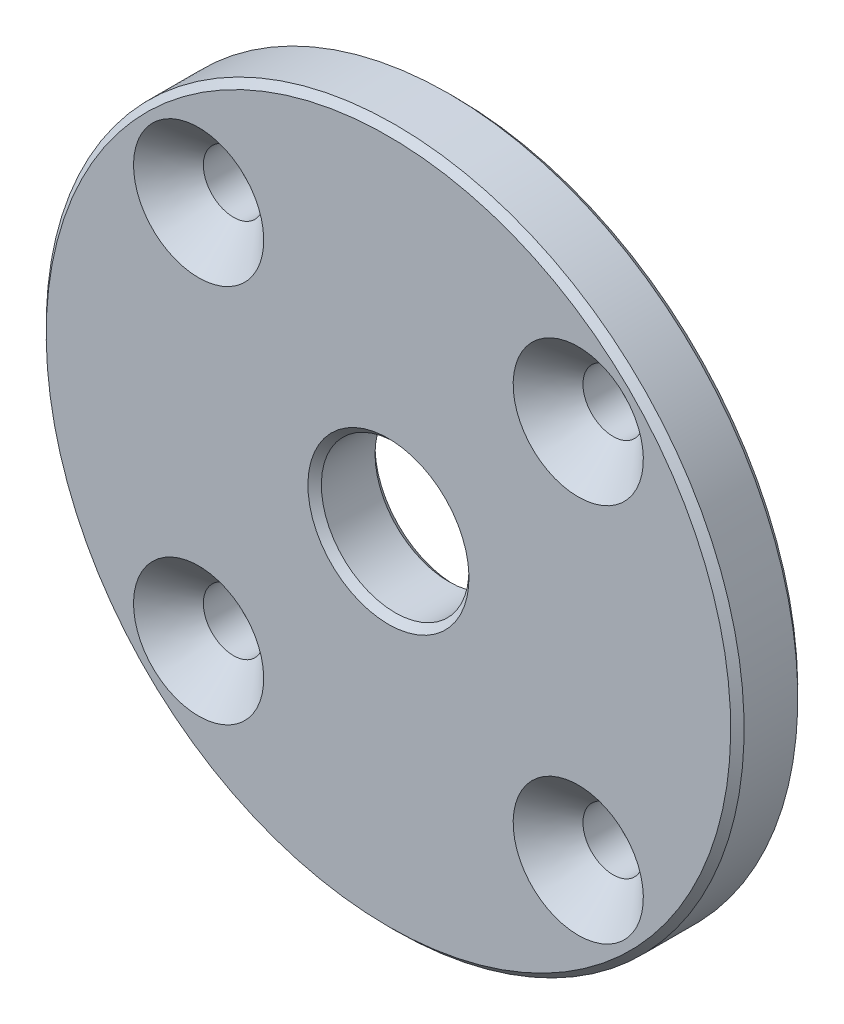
ISO-10303-21;
HEADER;
FILE_DESCRIPTION(('STEP AP214'),'2;1');
FILE_NAME('part.step','',(''),(''),'','','');
FILE_SCHEMA(('AUTOMOTIVE_DESIGN { 1 0 10303 214 1 1 1 1 }'));
ENDSEC;
DATA;
#1=APPLICATION_CONTEXT('core data for automotive mechanical design processes');
#2=APPLICATION_PROTOCOL_DEFINITION('international standard','automotive_design',2000,#1);
#3=PRODUCT_CONTEXT('',#1,'mechanical');
#4=PRODUCT('Part','Part','',(#3));
#5=PRODUCT_RELATED_PRODUCT_CATEGORY('part','',(#4));
#6=PRODUCT_DEFINITION_FORMATION('','',#4);
#7=PRODUCT_DEFINITION_CONTEXT('part definition',#1,'design');
#8=PRODUCT_DEFINITION('design','',#6,#7);
#9=PRODUCT_DEFINITION_SHAPE('','',#8);
#10=(LENGTH_UNIT() NAMED_UNIT(*) SI_UNIT(.MILLI.,.METRE.));
#11=(NAMED_UNIT(*) PLANE_ANGLE_UNIT() SI_UNIT($,.RADIAN.));
#12=(NAMED_UNIT(*) SI_UNIT($,.STERADIAN.) SOLID_ANGLE_UNIT());
#13=UNCERTAINTY_MEASURE_WITH_UNIT(LENGTH_MEASURE(1.E-05),#10,'distance_accuracy_value','');
#14=(GEOMETRIC_REPRESENTATION_CONTEXT(3) GLOBAL_UNCERTAINTY_ASSIGNED_CONTEXT((#13)) GLOBAL_UNIT_ASSIGNED_CONTEXT((#10,
#11,#12)) REPRESENTATION_CONTEXT('',''));
#15=CARTESIAN_POINT('',(0.,0.,0.));
#16=DIRECTION('',(0.,0.,1.));
#17=DIRECTION('',(1.,0.,0.));
#18=AXIS2_PLACEMENT_3D('',#15,#16,#17);
#19=CARTESIAN_POINT('',(5.5,0.,-5.));
#20=DIRECTION('',(0.,0.,-1.));
#21=DIRECTION('',(0.,1.,0.));
#22=AXIS2_PLACEMENT_3D('',#19,#20,#21);
#23=PLANE('',#22);
#24=CARTESIAN_POINT('',(0.,0.,-5.));
#25=DIRECTION('',(0.,0.,-1.));
#26=DIRECTION('',(0.,1.,0.));
#27=AXIS2_PLACEMENT_3D('',#24,#25,#26);
#28=CIRCLE('',#27,6.);
#29=CARTESIAN_POINT('',(0.,5.99999999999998,-5.00000000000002));
#30=VERTEX_POINT('',#29);
#31=EDGE_CURVE('E30',#30,#30,#28,.F.);
#32=ORIENTED_EDGE('',*,*,#31,.T.);
#33=EDGE_LOOP('',(#32));
#34=FACE_BOUND('',#33,.T.);
#35=CARTESIAN_POINT('',(14.1421356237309,14.142135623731,-5.));
#36=DIRECTION('',(0.,0.,-1.));
#37=DIRECTION('',(0.,1.,0.));
#38=AXIS2_PLACEMENT_3D('',#35,#36,#37);
#39=CIRCLE('',#38,2.25);
#40=CARTESIAN_POINT('',(14.1421356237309,16.392135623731,-5.00000000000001));
#41=VERTEX_POINT('',#40);
#42=EDGE_CURVE('E40',#41,#41,#39,.F.);
#43=ORIENTED_EDGE('',*,*,#42,.T.);
#44=EDGE_LOOP('',(#43));
#45=FACE_BOUND('',#44,.T.);
#46=CARTESIAN_POINT('',(-14.1421356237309,-14.142135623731,-5.));
#47=DIRECTION('',(0.,0.,-1.));
#48=DIRECTION('',(0.,1.,0.));
#49=AXIS2_PLACEMENT_3D('',#46,#47,#48);
#50=CIRCLE('',#49,2.25);
#51=CARTESIAN_POINT('',(-14.1421356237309,-11.892135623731,-5.00000000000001));
#52=VERTEX_POINT('',#51);
#53=EDGE_CURVE('E39',#52,#52,#50,.F.);
#54=ORIENTED_EDGE('',*,*,#53,.T.);
#55=EDGE_LOOP('',(#54));
#56=FACE_BOUND('',#55,.T.);
#57=CARTESIAN_POINT('',(0.,0.,-5.));
#58=DIRECTION('',(0.,0.,-1.));
#59=DIRECTION('',(0.,1.,0.));
#60=AXIS2_PLACEMENT_3D('',#57,#58,#59);
#61=CIRCLE('',#60,25.5);
#62=CARTESIAN_POINT('',(0.,25.5,-5.00000000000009));
#63=VERTEX_POINT('',#62);
#64=EDGE_CURVE('E35',#63,#63,#61,.T.);
#65=ORIENTED_EDGE('',*,*,#64,.T.);
#66=EDGE_LOOP('',(#65));
#67=FACE_BOUND('',#66,.T.);
#68=CARTESIAN_POINT('',(14.142135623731,-14.1421356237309,-5.));
#69=DIRECTION('',(0.,0.,-1.));
#70=DIRECTION('',(0.,1.,0.));
#71=AXIS2_PLACEMENT_3D('',#68,#69,#70);
#72=CIRCLE('',#71,2.25);
#73=CARTESIAN_POINT('',(14.142135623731,-11.8921356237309,-5.00000000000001));
#74=VERTEX_POINT('',#73);
#75=EDGE_CURVE('E36',#74,#74,#72,.F.);
#76=ORIENTED_EDGE('',*,*,#75,.T.);
#77=EDGE_LOOP('',(#76));
#78=FACE_BOUND('',#77,.T.);
#79=CARTESIAN_POINT('',(-14.142135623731,14.1421356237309,-5.));
#80=DIRECTION('',(0.,0.,-1.));
#81=DIRECTION('',(0.,1.,0.));
#82=AXIS2_PLACEMENT_3D('',#79,#80,#81);
#83=CIRCLE('',#82,2.25);
#84=CARTESIAN_POINT('',(-14.142135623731,16.3921356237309,-5.00000000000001));
#85=VERTEX_POINT('',#84);
#86=EDGE_CURVE('E43',#85,#85,#83,.F.);
#87=ORIENTED_EDGE('',*,*,#86,.T.);
#88=EDGE_LOOP('',(#87));
#89=FACE_BOUND('',#88,.T.);
#90=ADVANCED_FACE('F14',(#34,#45,#56,#67,#78,#89),#23,.T.);
#91=CARTESIAN_POINT('',(5.5,0.,0.));
#92=DIRECTION('',(0.,0.,1.));
#93=DIRECTION('',(0.,-1.,0.));
#94=AXIS2_PLACEMENT_3D('',#91,#92,#93);
#95=PLANE('',#94);
#96=CARTESIAN_POINT('',(0.,0.,0.));
#97=DIRECTION('',(0.,0.,1.));
#98=DIRECTION('',(0.,-1.,0.));
#99=AXIS2_PLACEMENT_3D('',#96,#97,#98);
#100=CIRCLE('',#99,6.);
#101=CARTESIAN_POINT('',(0.,-6.,0.));
#102=VERTEX_POINT('',#101);
#103=EDGE_CURVE('E9',#102,#102,#100,.F.);
#104=ORIENTED_EDGE('',*,*,#103,.T.);
#105=EDGE_LOOP('',(#104));
#106=FACE_BOUND('',#105,.T.);
#107=CARTESIAN_POINT('',(0.,0.,0.));
#108=DIRECTION('',(0.,0.,1.));
#109=DIRECTION('',(0.,-1.,0.));
#110=AXIS2_PLACEMENT_3D('',#107,#108,#109);
#111=CIRCLE('',#110,25.5);
#112=CARTESIAN_POINT('',(0.,-25.5,0.));
#113=VERTEX_POINT('',#112);
#114=EDGE_CURVE('E57',#113,#113,#111,.T.);
#115=ORIENTED_EDGE('',*,*,#114,.T.);
#116=EDGE_LOOP('',(#115));
#117=FACE_BOUND('',#116,.T.);
#118=CARTESIAN_POINT('',(-14.142135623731,14.1421356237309,0.));
#119=DIRECTION('',(0.,0.,1.));
#120=DIRECTION('',(0.,-1.,0.));
#121=AXIS2_PLACEMENT_3D('',#118,#119,#120);
#122=CIRCLE('',#121,4.85);
#123=CARTESIAN_POINT('',(-14.142135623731,9.29213562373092,0.));
#124=VERTEX_POINT('',#123);
#125=EDGE_CURVE('E63',#124,#124,#122,.T.);
#126=ORIENTED_EDGE('',*,*,#125,.F.);
#127=EDGE_LOOP('',(#126));
#128=FACE_BOUND('',#127,.T.);
#129=CARTESIAN_POINT('',(-14.1421356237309,-14.142135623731,0.));
#130=DIRECTION('',(0.,0.,1.));
#131=DIRECTION('',(0.,-1.,0.));
#132=AXIS2_PLACEMENT_3D('',#129,#130,#131);
#133=CIRCLE('',#132,4.85);
#134=CARTESIAN_POINT('',(-14.1421356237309,-18.992135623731,0.));
#135=VERTEX_POINT('',#134);
#136=EDGE_CURVE('E69',#135,#135,#133,.T.);
#137=ORIENTED_EDGE('',*,*,#136,.F.);
#138=EDGE_LOOP('',(#137));
#139=FACE_BOUND('',#138,.T.);
#140=CARTESIAN_POINT('',(14.142135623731,-14.1421356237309,0.));
#141=DIRECTION('',(0.,0.,1.));
#142=DIRECTION('',(0.,-1.,0.));
#143=AXIS2_PLACEMENT_3D('',#140,#141,#142);
#144=CIRCLE('',#143,4.85);
#145=CARTESIAN_POINT('',(14.142135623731,-18.9921356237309,0.));
#146=VERTEX_POINT('',#145);
#147=EDGE_CURVE('E75',#146,#146,#144,.T.);
#148=ORIENTED_EDGE('',*,*,#147,.F.);
#149=EDGE_LOOP('',(#148));
#150=FACE_BOUND('',#149,.T.);
#151=CARTESIAN_POINT('',(14.1421356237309,14.142135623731,0.));
#152=DIRECTION('',(0.,0.,1.));
#153=DIRECTION('',(0.,-1.,0.));
#154=AXIS2_PLACEMENT_3D('',#151,#152,#153);
#155=CIRCLE('',#154,4.85);
#156=CARTESIAN_POINT('',(14.1421356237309,9.29213562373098,0.));
#157=VERTEX_POINT('',#156);
#158=EDGE_CURVE('E48',#157,#157,#155,.T.);
#159=ORIENTED_EDGE('',*,*,#158,.F.);
#160=EDGE_LOOP('',(#159));
#161=FACE_BOUND('',#160,.T.);
#162=ADVANCED_FACE('F86',(#106,#117,#128,#139,#150,#161),#95,.T.);
#163=CARTESIAN_POINT('',(0.,0.,0.));
#164=DIRECTION('',(0.,0.,1.));
#165=DIRECTION('',(0.,-1.,0.));
#166=AXIS2_PLACEMENT_3D('',#163,#164,#165);
#167=CYLINDRICAL_SURFACE('',#166,26.);
#168=CARTESIAN_POINT('',(0.,0.,-0.5));
#169=DIRECTION('',(0.,0.,1.));
#170=DIRECTION('',(0.,-1.,0.));
#171=AXIS2_PLACEMENT_3D('',#168,#169,#170);
#172=CIRCLE('',#171,26.);
#173=CARTESIAN_POINT('',(0.,-26.,-0.499999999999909));
#174=VERTEX_POINT('',#173);
#175=EDGE_CURVE('E51',#174,#174,#172,.F.);
#176=ORIENTED_EDGE('',*,*,#175,.T.);
#177=EDGE_LOOP('',(#176));
#178=FACE_BOUND('',#177,.T.);
#179=CARTESIAN_POINT('',(0.,0.,-4.5));
#180=DIRECTION('',(0.,0.,-1.));
#181=DIRECTION('',(0.,1.,0.));
#182=AXIS2_PLACEMENT_3D('',#179,#180,#181);
#183=CIRCLE('',#182,26.);
#184=CARTESIAN_POINT('',(0.,26.,-4.50000000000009));
#185=VERTEX_POINT('',#184);
#186=EDGE_CURVE('E54',#185,#185,#183,.F.);
#187=ORIENTED_EDGE('',*,*,#186,.T.);
#188=EDGE_LOOP('',(#187));
#189=FACE_BOUND('',#188,.T.);
#190=ADVANCED_FACE('F88',(#178,#189),#167,.T.);
#191=CARTESIAN_POINT('',(0.,0.,0.));
#192=DIRECTION('',(0.,0.,-1.));
#193=DIRECTION('',(0.,1.,0.));
#194=AXIS2_PLACEMENT_3D('',#191,#192,#193);
#195=CONICAL_SURFACE('',#194,25.5,0.785398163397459);
#196=ORIENTED_EDGE('',*,*,#175,.F.);
#197=EDGE_LOOP('',(#196));
#198=FACE_BOUND('',#197,.T.);
#199=ORIENTED_EDGE('',*,*,#114,.F.);
#200=EDGE_LOOP('',(#199));
#201=FACE_BOUND('',#200,.T.);
#202=ADVANCED_FACE('F96',(#198,#201),#195,.T.);
#203=CARTESIAN_POINT('',(0.,0.,-4.5));
#204=DIRECTION('',(0.,0.,1.));
#205=DIRECTION('',(0.,-1.,0.));
#206=AXIS2_PLACEMENT_3D('',#203,#204,#205);
#207=CONICAL_SURFACE('',#206,26.,0.785398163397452);
#208=ORIENTED_EDGE('',*,*,#64,.F.);
#209=EDGE_LOOP('',(#208));
#210=FACE_BOUND('',#209,.T.);
#211=ORIENTED_EDGE('',*,*,#186,.F.);
#212=EDGE_LOOP('',(#211));
#213=FACE_BOUND('',#212,.T.);
#214=ADVANCED_FACE('F108',(#210,#213),#207,.T.);
#215=CARTESIAN_POINT('',(-14.142135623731,14.1421356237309,0.));
#216=DIRECTION('',(0.,0.,1.));
#217=DIRECTION('',(0.,-1.,0.));
#218=AXIS2_PLACEMENT_3D('',#215,#216,#217);
#219=CYLINDRICAL_SURFACE('',#218,2.25);
#220=CARTESIAN_POINT('',(-14.142135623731,14.1421356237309,-2.60000000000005));
#221=DIRECTION('',(0.,0.,1.));
#222=DIRECTION('',(0.,-1.,0.));
#223=AXIS2_PLACEMENT_3D('',#220,#221,#222);
#224=CIRCLE('',#223,2.25);
#225=CARTESIAN_POINT('',(-14.142135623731,11.8921356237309,-2.60000000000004));
#226=VERTEX_POINT('',#225);
#227=EDGE_CURVE('E60',#226,#226,#224,.T.);
#228=ORIENTED_EDGE('',*,*,#227,.T.);
#229=EDGE_LOOP('',(#228));
#230=FACE_BOUND('',#229,.T.);
#231=ORIENTED_EDGE('',*,*,#86,.F.);
#232=EDGE_LOOP('',(#231));
#233=FACE_BOUND('',#232,.T.);
#234=ADVANCED_FACE('F112',(#230,#233),#219,.F.);
#235=CARTESIAN_POINT('',(-14.142135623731,14.1421356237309,0.));
#236=DIRECTION('',(0.,0.,1.));
#237=DIRECTION('',(0.,-1.,0.));
#238=AXIS2_PLACEMENT_3D('',#235,#236,#237);
#239=CONICAL_SURFACE('',#238,4.85,0.785398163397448);
#240=ORIENTED_EDGE('',*,*,#227,.F.);
#241=EDGE_LOOP('',(#240));
#242=FACE_BOUND('',#241,.T.);
#243=ORIENTED_EDGE('',*,*,#125,.T.);
#244=EDGE_LOOP('',(#243));
#245=FACE_BOUND('',#244,.T.);
#246=ADVANCED_FACE('F103',(#242,#245),#239,.F.);
#247=CARTESIAN_POINT('',(-14.1421356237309,-14.142135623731,0.));
#248=DIRECTION('',(0.,0.,1.));
#249=DIRECTION('',(0.,-1.,0.));
#250=AXIS2_PLACEMENT_3D('',#247,#248,#249);
#251=CYLINDRICAL_SURFACE('',#250,2.25);
#252=CARTESIAN_POINT('',(-14.1421356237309,-14.142135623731,-2.59999999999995));
#253=DIRECTION('',(0.,0.,1.));
#254=DIRECTION('',(0.,-1.,0.));
#255=AXIS2_PLACEMENT_3D('',#252,#253,#254);
#256=CIRCLE('',#255,2.25);
#257=CARTESIAN_POINT('',(-14.1421356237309,-16.392135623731,-2.59999999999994));
#258=VERTEX_POINT('',#257);
#259=EDGE_CURVE('E66',#258,#258,#256,.T.);
#260=ORIENTED_EDGE('',*,*,#259,.T.);
#261=EDGE_LOOP('',(#260));
#262=FACE_BOUND('',#261,.T.);
#263=ORIENTED_EDGE('',*,*,#53,.F.);
#264=EDGE_LOOP('',(#263));
#265=FACE_BOUND('',#264,.T.);
#266=ADVANCED_FACE('F118',(#262,#265),#251,.F.);
#267=CARTESIAN_POINT('',(-14.1421356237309,-14.142135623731,0.));
#268=DIRECTION('',(0.,0.,1.));
#269=DIRECTION('',(0.,-1.,0.));
#270=AXIS2_PLACEMENT_3D('',#267,#268,#269);
#271=CONICAL_SURFACE('',#270,4.85,0.785398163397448);
#272=ORIENTED_EDGE('',*,*,#259,.F.);
#273=EDGE_LOOP('',(#272));
#274=FACE_BOUND('',#273,.T.);
#275=ORIENTED_EDGE('',*,*,#136,.T.);
#276=EDGE_LOOP('',(#275));
#277=FACE_BOUND('',#276,.T.);
#278=ADVANCED_FACE('F121',(#274,#277),#271,.F.);
#279=CARTESIAN_POINT('',(14.142135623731,-14.1421356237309,0.));
#280=DIRECTION('',(0.,0.,1.));
#281=DIRECTION('',(0.,-1.,0.));
#282=AXIS2_PLACEMENT_3D('',#279,#280,#281);
#283=CYLINDRICAL_SURFACE('',#282,2.25);
#284=CARTESIAN_POINT('',(14.142135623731,-14.1421356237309,-2.59999999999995));
#285=DIRECTION('',(0.,0.,1.));
#286=DIRECTION('',(0.,-1.,0.));
#287=AXIS2_PLACEMENT_3D('',#284,#285,#286);
#288=CIRCLE('',#287,2.25);
#289=CARTESIAN_POINT('',(14.142135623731,-16.3921356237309,-2.59999999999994));
#290=VERTEX_POINT('',#289);
#291=EDGE_CURVE('E72',#290,#290,#288,.T.);
#292=ORIENTED_EDGE('',*,*,#291,.T.);
#293=EDGE_LOOP('',(#292));
#294=FACE_BOUND('',#293,.T.);
#295=ORIENTED_EDGE('',*,*,#75,.F.);
#296=EDGE_LOOP('',(#295));
#297=FACE_BOUND('',#296,.T.);
#298=ADVANCED_FACE('F123',(#294,#297),#283,.F.);
#299=CARTESIAN_POINT('',(14.142135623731,-14.1421356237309,0.));
#300=DIRECTION('',(0.,0.,1.));
#301=DIRECTION('',(0.,-1.,0.));
#302=AXIS2_PLACEMENT_3D('',#299,#300,#301);
#303=CONICAL_SURFACE('',#302,4.85,0.785398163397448);
#304=ORIENTED_EDGE('',*,*,#291,.F.);
#305=EDGE_LOOP('',(#304));
#306=FACE_BOUND('',#305,.T.);
#307=ORIENTED_EDGE('',*,*,#147,.T.);
#308=EDGE_LOOP('',(#307));
#309=FACE_BOUND('',#308,.T.);
#310=ADVANCED_FACE('F126',(#306,#309),#303,.F.);
#311=CARTESIAN_POINT('',(14.1421356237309,14.142135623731,0.));
#312=DIRECTION('',(0.,0.,1.));
#313=DIRECTION('',(0.,-1.,0.));
#314=AXIS2_PLACEMENT_3D('',#311,#312,#313);
#315=CYLINDRICAL_SURFACE('',#314,2.25);
#316=CARTESIAN_POINT('',(14.1421356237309,14.142135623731,-2.60000000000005));
#317=DIRECTION('',(0.,0.,1.));
#318=DIRECTION('',(0.,-1.,0.));
#319=AXIS2_PLACEMENT_3D('',#316,#317,#318);
#320=CIRCLE('',#319,2.25);
#321=CARTESIAN_POINT('',(14.1421356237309,11.892135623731,-2.60000000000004));
#322=VERTEX_POINT('',#321);
#323=EDGE_CURVE('E78',#322,#322,#320,.T.);
#324=ORIENTED_EDGE('',*,*,#323,.T.);
#325=EDGE_LOOP('',(#324));
#326=FACE_BOUND('',#325,.T.);
#327=ORIENTED_EDGE('',*,*,#42,.F.);
#328=EDGE_LOOP('',(#327));
#329=FACE_BOUND('',#328,.T.);
#330=ADVANCED_FACE('F128',(#326,#329),#315,.F.);
#331=CARTESIAN_POINT('',(14.1421356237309,14.142135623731,0.));
#332=DIRECTION('',(0.,0.,1.));
#333=DIRECTION('',(0.,-1.,0.));
#334=AXIS2_PLACEMENT_3D('',#331,#332,#333);
#335=CONICAL_SURFACE('',#334,4.85,0.785398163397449);
#336=ORIENTED_EDGE('',*,*,#323,.F.);
#337=EDGE_LOOP('',(#336));
#338=FACE_BOUND('',#337,.T.);
#339=ORIENTED_EDGE('',*,*,#158,.T.);
#340=EDGE_LOOP('',(#339));
#341=FACE_BOUND('',#340,.T.);
#342=ADVANCED_FACE('F84',(#338,#341),#335,.F.);
#343=CARTESIAN_POINT('',(0.,0.,0.));
#344=DIRECTION('',(0.,0.,1.));
#345=DIRECTION('',(0.,-1.,0.));
#346=AXIS2_PLACEMENT_3D('',#343,#344,#345);
#347=CYLINDRICAL_SURFACE('',#346,5.5);
#348=CARTESIAN_POINT('',(0.,0.,-4.5));
#349=DIRECTION('',(0.,0.,-1.));
#350=DIRECTION('',(0.,1.,0.));
#351=AXIS2_PLACEMENT_3D('',#348,#349,#350);
#352=CIRCLE('',#351,5.5);
#353=CARTESIAN_POINT('',(0.,5.49999999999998,-4.50000000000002));
#354=VERTEX_POINT('',#353);
#355=EDGE_CURVE('E22',#354,#354,#352,.T.);
#356=ORIENTED_EDGE('',*,*,#355,.T.);
#357=EDGE_LOOP('',(#356));
#358=FACE_BOUND('',#357,.T.);
#359=CARTESIAN_POINT('',(0.,0.,-0.5));
#360=DIRECTION('',(0.,0.,1.));
#361=DIRECTION('',(0.,-1.,0.));
#362=AXIS2_PLACEMENT_3D('',#359,#360,#361);
#363=CIRCLE('',#362,5.5);
#364=CARTESIAN_POINT('',(0.,-5.5,-0.499999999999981));
#365=VERTEX_POINT('',#364);
#366=EDGE_CURVE('E26',#365,#365,#363,.T.);
#367=ORIENTED_EDGE('',*,*,#366,.T.);
#368=EDGE_LOOP('',(#367));
#369=FACE_BOUND('',#368,.T.);
#370=ADVANCED_FACE('F114',(#358,#369),#347,.F.);
#371=CARTESIAN_POINT('',(0.,0.,-5.));
#372=DIRECTION('',(0.,0.,-1.));
#373=DIRECTION('',(0.,1.,0.));
#374=AXIS2_PLACEMENT_3D('',#371,#372,#373);
#375=CONICAL_SURFACE('',#374,6.,0.785398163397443);
#376=ORIENTED_EDGE('',*,*,#355,.F.);
#377=EDGE_LOOP('',(#376));
#378=FACE_BOUND('',#377,.T.);
#379=ORIENTED_EDGE('',*,*,#31,.F.);
#380=EDGE_LOOP('',(#379));
#381=FACE_BOUND('',#380,.T.);
#382=ADVANCED_FACE('F117',(#378,#381),#375,.F.);
#383=CARTESIAN_POINT('',(0.,0.,0.));
#384=DIRECTION('',(0.,0.,1.));
#385=DIRECTION('',(0.,-1.,0.));
#386=AXIS2_PLACEMENT_3D('',#383,#384,#385);
#387=CONICAL_SURFACE('',#386,6.,0.785398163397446);
#388=ORIENTED_EDGE('',*,*,#366,.F.);
#389=EDGE_LOOP('',(#388));
#390=FACE_BOUND('',#389,.T.);
#391=ORIENTED_EDGE('',*,*,#103,.F.);
#392=EDGE_LOOP('',(#391));
#393=FACE_BOUND('',#392,.T.);
#394=ADVANCED_FACE('F17',(#390,#393),#387,.F.);
#395=CLOSED_SHELL('',(#90,#162,#190,#202,#214,#234,#246,#266,#278,#298,#310,#330,#342,#370,#382,#394));
#396=MANIFOLD_SOLID_BREP('B1',#395);
#397=ADVANCED_BREP_SHAPE_REPRESENTATION('',(#18,#396),#14);
#398=SHAPE_DEFINITION_REPRESENTATION(#9,#397);
ENDSEC;
END-ISO-10303-21;
